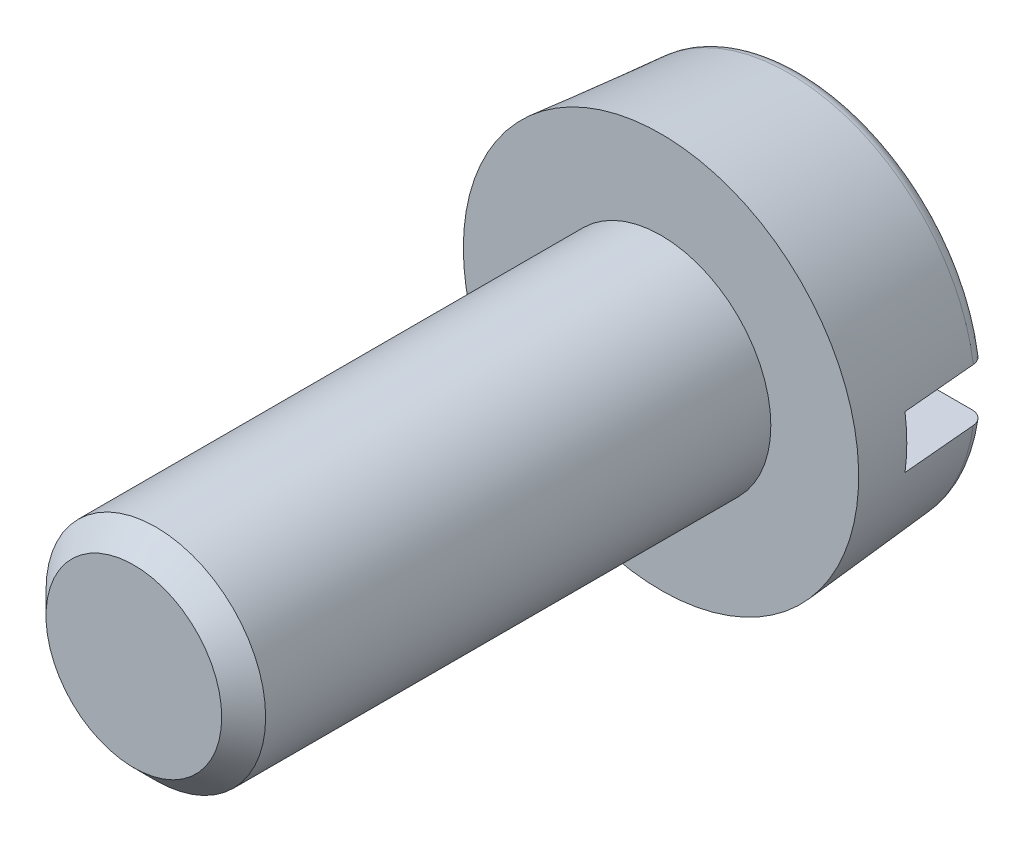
from build123d import *

# Parameters (mm, degrees)
ESQUISSE2_W             = 4.5
ESQUISSE2_H             = 0.6
ENLEV_MAT_EXTRU_1_DEPTH = 1
ESQUISSE3_W             = 1.25
ESQUISSE3_H             = 6
CHANFREIN1_SIZE         = 0.25


with BuildPart() as part:
    # Esquisse1 → Base-R_volution (revolve)
    with BuildSketch(Plane(origin=(0, 0, 0), x_dir=(1, 0, 0), z_dir=(0, 1, 0))):
        with BuildLine():
            Line((0, 0), (2.25, 0))
            Line((2.25, 0), (2.122796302, 1.453944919))
            ThreePointArc((2.122796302, 1.453944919), (2.071499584, 1.557964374), (1.963405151, 1.6))
            Line((1.963405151, 1.6), (0, 1.6))
            Line((0, 1.6), (0, 0))
        make_face()
    revolve(axis=Axis((0, 0, 0), (0, 0, -1)))

    # Esquisse2 → Enlev. mat.-Extru.1 (cut)
    with BuildSketch(Plane.XY.offset(-1.6)):
        Rectangle(ESQUISSE2_W, ESQUISSE2_H)
    extrude(amount=ENLEV_MAT_EXTRU_1_DEPTH, mode=Mode.SUBTRACT)

    # Esquisse3 → Boss.-R_vol.1 (revolve)
    with BuildSketch(Plane(origin=(0, 0, 0), x_dir=(1, 0, 0), z_dir=(0, 1, 0))):
        with Locations((0.625, -3)):
            Rectangle(ESQUISSE3_W, ESQUISSE3_H)
    revolve(axis=Axis((0, 0, 0), (0, 0, 1)))

    # Chanfrein1
    chanfrein1_edges = [part.edges().sort_by_distance(p)[0] for p in [
        (-1.25, 0, 6),
    ]]
    chamfer(chanfrein1_edges, length=CHANFREIN1_SIZE)


solid = part.part
